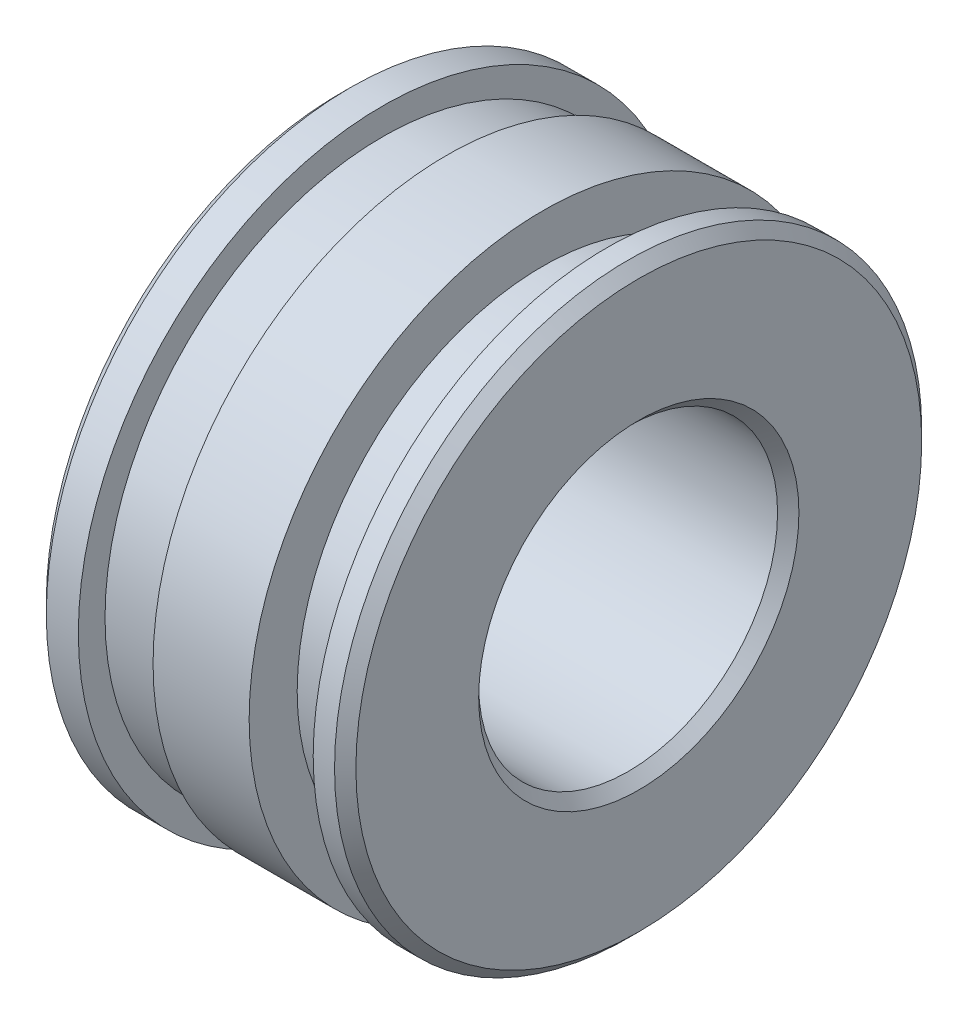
from build123d import *

# Parameters (mm, degrees)
CHANFREIN1_SIZE = 1


with BuildPart() as part:
    # Esquisse1 → R_volution1 (revolve)
    with BuildSketch(Plane.XY, mode=Mode.PRIVATE) as r_volution1_sk:
        Polygon((28, 14), (28, 27.5), (25, 27.5), (25, 23), (19, 23), (19, 27.5), (10, 27.5), (10, 26), (4, 26), (4, 28.5), (0, 28.5), (0, 14), align=None)
    revolve(r_volution1_sk.sketch.rotate(Axis((-19.247988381, 0, 0), (1, 0, 0)), 90), axis=Axis((-19.247988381, 0, 0), (1, 0, 0)))

    # Chanfrein1
    chanfrein1_edges = [part.edges().sort_by_distance(p)[0] for p in [
        (0, 0, -14),
        (28, 0, -14),
        (28, 0, -27.5),
        (0, 0, -28.5),
    ]]
    chamfer(chanfrein1_edges, length=CHANFREIN1_SIZE)


solid = part.part
